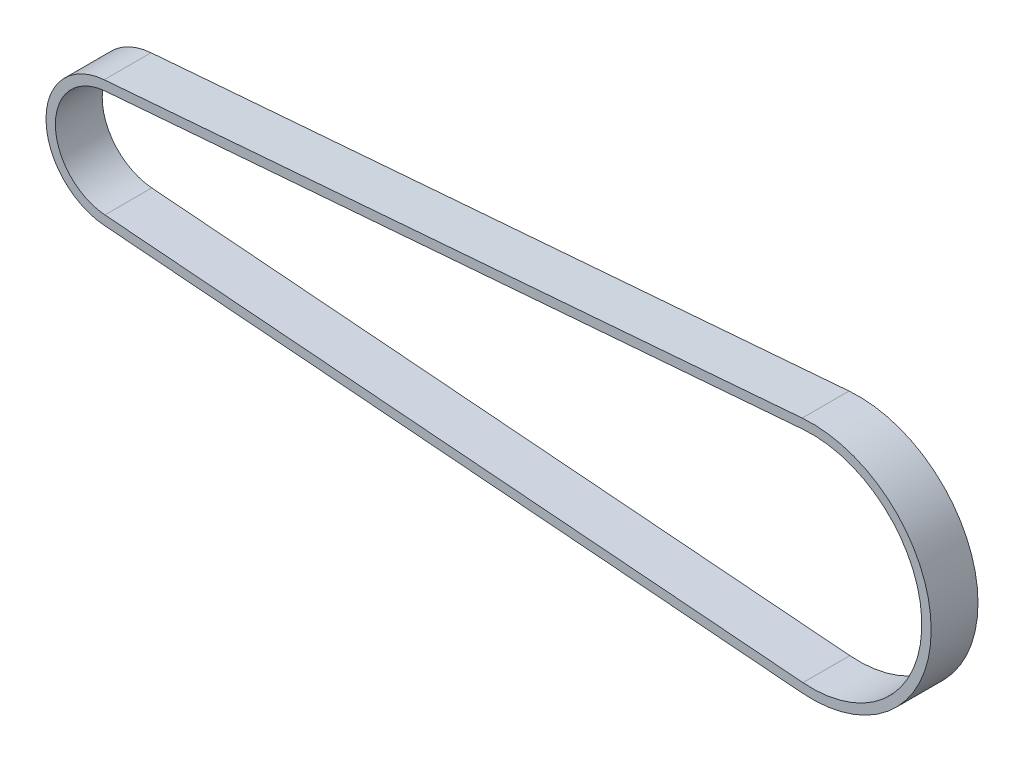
ISO-10303-21;
HEADER;
FILE_DESCRIPTION(('STEP AP214'),'2;1');
FILE_NAME('part.step','',(''),(''),'','','');
FILE_SCHEMA(('AUTOMOTIVE_DESIGN { 1 0 10303 214 1 1 1 1 }'));
ENDSEC;
DATA;
#1=APPLICATION_CONTEXT('core data for automotive mechanical design processes');
#2=APPLICATION_PROTOCOL_DEFINITION('international standard','automotive_design',2000,#1);
#3=PRODUCT_CONTEXT('',#1,'mechanical');
#4=PRODUCT('Part','Part','',(#3));
#5=PRODUCT_RELATED_PRODUCT_CATEGORY('part','',(#4));
#6=PRODUCT_DEFINITION_FORMATION('','',#4);
#7=PRODUCT_DEFINITION_CONTEXT('part definition',#1,'design');
#8=PRODUCT_DEFINITION('design','',#6,#7);
#9=PRODUCT_DEFINITION_SHAPE('','',#8);
#10=(LENGTH_UNIT() NAMED_UNIT(*) SI_UNIT(.MILLI.,.METRE.));
#11=(NAMED_UNIT(*) PLANE_ANGLE_UNIT() SI_UNIT($,.RADIAN.));
#12=(NAMED_UNIT(*) SI_UNIT($,.STERADIAN.) SOLID_ANGLE_UNIT());
#13=UNCERTAINTY_MEASURE_WITH_UNIT(LENGTH_MEASURE(1.E-05),#10,'distance_accuracy_value','');
#14=(GEOMETRIC_REPRESENTATION_CONTEXT(3) GLOBAL_UNCERTAINTY_ASSIGNED_CONTEXT((#13)) GLOBAL_UNIT_ASSIGNED_CONTEXT((#10,
#11,#12)) REPRESENTATION_CONTEXT('',''));
#15=CARTESIAN_POINT('',(0.,0.,0.));
#16=DIRECTION('',(0.,0.,1.));
#17=DIRECTION('',(1.,0.,0.));
#18=AXIS2_PLACEMENT_3D('',#15,#16,#17);
#19=CARTESIAN_POINT('',(-150.,0.,10.));
#20=DIRECTION('',(0.,0.,1.));
#21=DIRECTION('',(1.,0.,0.));
#22=AXIS2_PLACEMENT_3D('',#19,#20,#21);
#23=PLANE('',#22);
#24=CARTESIAN_POINT('',(-150.,0.,10.));
#25=DIRECTION('',(0.,0.,1.));
#26=DIRECTION('',(1.,0.,0.));
#27=AXIS2_PLACEMENT_3D('',#24,#25,#26);
#28=CIRCLE('',#27,13.5);
#29=CARTESIAN_POINT('',(-151.08,13.4567306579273,10.));
#30=VERTEX_POINT('',#29);
#31=CARTESIAN_POINT('',(-151.08,-13.4567306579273,10.));
#32=VERTEX_POINT('',#31);
#33=EDGE_CURVE('E155',#30,#32,#28,.T.);
#34=ORIENTED_EDGE('',*,*,#33,.T.);
#35=DIRECTION('',(0.996794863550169,-0.0799999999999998,0.));
#36=VECTOR('',#35,1.);
#37=CARTESIAN_POINT('',(-151.08,-13.4567306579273,10.));
#38=LINE('',#37,#36);
#39=CARTESIAN_POINT('',(-2.03999999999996,-25.4182690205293,10.));
#40=VERTEX_POINT('',#39);
#41=EDGE_CURVE('E158',#32,#40,#38,.T.);
#42=ORIENTED_EDGE('',*,*,#41,.T.);
#43=CARTESIAN_POINT('',(0.,0.,10.));
#44=DIRECTION('',(0.,0.,1.));
#45=DIRECTION('',(1.,0.,0.));
#46=AXIS2_PLACEMENT_3D('',#43,#44,#45);
#47=CIRCLE('',#46,25.5);
#48=CARTESIAN_POINT('',(-2.04,25.4182690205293,10.));
#49=VERTEX_POINT('',#48);
#50=EDGE_CURVE('E161',#40,#49,#47,.T.);
#51=ORIENTED_EDGE('',*,*,#50,.T.);
#52=DIRECTION('',(-0.996794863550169,-0.08,0.));
#53=VECTOR('',#52,1.);
#54=CARTESIAN_POINT('',(-151.08,13.4567306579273,10.));
#55=LINE('',#54,#53);
#56=EDGE_CURVE('E163',#49,#30,#55,.T.);
#57=ORIENTED_EDGE('',*,*,#56,.T.);
#58=EDGE_LOOP('',(#34,#42,#51,#57));
#59=FACE_BOUND('',#58,.T.);
#60=DIRECTION('',(0.996794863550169,-0.0799999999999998,0.));
#61=VECTOR('',#60,1.);
#62=CARTESIAN_POINT('',(-150.92,-11.463140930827,10.));
#63=LINE('',#62,#61);
#64=CARTESIAN_POINT('',(-150.92,-11.463140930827,10.));
#65=VERTEX_POINT('',#64);
#66=CARTESIAN_POINT('',(-1.88,-23.424679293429,10.));
#67=VERTEX_POINT('',#66);
#68=EDGE_CURVE('E127',#65,#67,#63,.T.);
#69=ORIENTED_EDGE('',*,*,#68,.F.);
#70=CARTESIAN_POINT('',(-150.,0.,10.));
#71=DIRECTION('',(0.,0.,1.));
#72=DIRECTION('',(1.,0.,0.));
#73=AXIS2_PLACEMENT_3D('',#70,#71,#72);
#74=CIRCLE('',#73,11.5);
#75=CARTESIAN_POINT('',(-150.92,11.4631409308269,10.));
#76=VERTEX_POINT('',#75);
#77=EDGE_CURVE('E119',#76,#65,#74,.T.);
#78=ORIENTED_EDGE('',*,*,#77,.F.);
#79=DIRECTION('',(-0.996794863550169,-0.08,0.));
#80=VECTOR('',#79,1.);
#81=CARTESIAN_POINT('',(-150.92,11.4631409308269,10.));
#82=LINE('',#81,#80);
#83=CARTESIAN_POINT('',(-1.88000000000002,23.424679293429,10.));
#84=VERTEX_POINT('',#83);
#85=EDGE_CURVE('E141',#84,#76,#82,.T.);
#86=ORIENTED_EDGE('',*,*,#85,.F.);
#87=CARTESIAN_POINT('',(0.,0.,10.));
#88=DIRECTION('',(0.,0.,1.));
#89=DIRECTION('',(1.,0.,0.));
#90=AXIS2_PLACEMENT_3D('',#87,#88,#89);
#91=CIRCLE('',#90,23.5);
#92=EDGE_CURVE('E139',#67,#84,#91,.T.);
#93=ORIENTED_EDGE('',*,*,#92,.F.);
#94=EDGE_LOOP('',(#69,#78,#86,#93));
#95=FACE_BOUND('',#94,.T.);
#96=ADVANCED_FACE('F54',(#59,#95),#23,.T.);
#97=CARTESIAN_POINT('',(-150.,0.,0.));
#98=DIRECTION('',(0.,0.,1.));
#99=DIRECTION('',(1.,0.,0.));
#100=AXIS2_PLACEMENT_3D('',#97,#98,#99);
#101=PLANE('',#100);
#102=CARTESIAN_POINT('',(-150.,0.,0.));
#103=DIRECTION('',(0.,0.,1.));
#104=DIRECTION('',(1.,0.,0.));
#105=AXIS2_PLACEMENT_3D('',#102,#103,#104);
#106=CIRCLE('',#105,13.5);
#107=CARTESIAN_POINT('',(-151.08,13.4567306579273,0.));
#108=VERTEX_POINT('',#107);
#109=CARTESIAN_POINT('',(-151.08,-13.4567306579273,0.));
#110=VERTEX_POINT('',#109);
#111=EDGE_CURVE('E135',#108,#110,#106,.T.);
#112=ORIENTED_EDGE('',*,*,#111,.F.);
#113=DIRECTION('',(-0.996794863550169,-0.08,0.));
#114=VECTOR('',#113,1.);
#115=CARTESIAN_POINT('',(-151.08,13.4567306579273,0.));
#116=LINE('',#115,#114);
#117=CARTESIAN_POINT('',(-2.04,25.4182690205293,0.));
#118=VERTEX_POINT('',#117);
#119=EDGE_CURVE('E159',#118,#108,#116,.T.);
#120=ORIENTED_EDGE('',*,*,#119,.F.);
#121=CARTESIAN_POINT('',(0.,0.,0.));
#122=DIRECTION('',(0.,0.,1.));
#123=DIRECTION('',(1.,0.,0.));
#124=AXIS2_PLACEMENT_3D('',#121,#122,#123);
#125=CIRCLE('',#124,25.5);
#126=CARTESIAN_POINT('',(-2.03999999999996,-25.4182690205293,0.));
#127=VERTEX_POINT('',#126);
#128=EDGE_CURVE('E170',#127,#118,#125,.T.);
#129=ORIENTED_EDGE('',*,*,#128,.F.);
#130=DIRECTION('',(0.996794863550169,-0.0799999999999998,0.));
#131=VECTOR('',#130,1.);
#132=CARTESIAN_POINT('',(-151.08,-13.4567306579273,0.));
#133=LINE('',#132,#131);
#134=EDGE_CURVE('E168',#110,#127,#133,.T.);
#135=ORIENTED_EDGE('',*,*,#134,.F.);
#136=EDGE_LOOP('',(#112,#120,#129,#135));
#137=FACE_BOUND('',#136,.T.);
#138=CARTESIAN_POINT('',(-150.,0.,0.));
#139=DIRECTION('',(0.,0.,1.));
#140=DIRECTION('',(1.,0.,0.));
#141=AXIS2_PLACEMENT_3D('',#138,#139,#140);
#142=CIRCLE('',#141,11.5);
#143=CARTESIAN_POINT('',(-150.92,11.4631409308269,0.));
#144=VERTEX_POINT('',#143);
#145=CARTESIAN_POINT('',(-150.92,-11.463140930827,0.));
#146=VERTEX_POINT('',#145);
#147=EDGE_CURVE('E77',#144,#146,#142,.T.);
#148=ORIENTED_EDGE('',*,*,#147,.T.);
#149=DIRECTION('',(0.996794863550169,-0.0799999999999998,0.));
#150=VECTOR('',#149,1.);
#151=CARTESIAN_POINT('',(-150.92,-11.463140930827,0.));
#152=LINE('',#151,#150);
#153=CARTESIAN_POINT('',(-1.88,-23.424679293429,0.));
#154=VERTEX_POINT('',#153);
#155=EDGE_CURVE('E134',#146,#154,#152,.T.);
#156=ORIENTED_EDGE('',*,*,#155,.T.);
#157=CARTESIAN_POINT('',(0.,0.,0.));
#158=DIRECTION('',(0.,0.,1.));
#159=DIRECTION('',(1.,0.,0.));
#160=AXIS2_PLACEMENT_3D('',#157,#158,#159);
#161=CIRCLE('',#160,23.5);
#162=CARTESIAN_POINT('',(-1.88,23.424679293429,0.));
#163=VERTEX_POINT('',#162);
#164=EDGE_CURVE('E147',#154,#163,#161,.T.);
#165=ORIENTED_EDGE('',*,*,#164,.T.);
#166=DIRECTION('',(-0.996794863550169,-0.08,0.));
#167=VECTOR('',#166,1.);
#168=CARTESIAN_POINT('',(-150.92,11.4631409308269,0.));
#169=LINE('',#168,#167);
#170=EDGE_CURVE('E128',#163,#144,#169,.T.);
#171=ORIENTED_EDGE('',*,*,#170,.T.);
#172=EDGE_LOOP('',(#148,#156,#165,#171));
#173=FACE_BOUND('',#172,.T.);
#174=ADVANCED_FACE('F188',(#137,#173),#101,.F.);
#175=CARTESIAN_POINT('',(-150.,0.,10.));
#176=DIRECTION('',(0.,0.,-1.));
#177=DIRECTION('',(-1.,0.,0.));
#178=AXIS2_PLACEMENT_3D('',#175,#176,#177);
#179=CYLINDRICAL_SURFACE('',#178,13.5);
#180=ORIENTED_EDGE('',*,*,#111,.T.);
#181=DIRECTION('',(0.,0.,-1.));
#182=VECTOR('',#181,1.);
#183=CARTESIAN_POINT('',(-151.08,-13.4567306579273,10.));
#184=LINE('',#183,#182);
#185=EDGE_CURVE('E12',#32,#110,#184,.T.);
#186=ORIENTED_EDGE('',*,*,#185,.F.);
#187=ORIENTED_EDGE('',*,*,#33,.F.);
#188=DIRECTION('',(0.,0.,-1.));
#189=VECTOR('',#188,1.);
#190=CARTESIAN_POINT('',(-151.08,13.4567306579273,10.));
#191=LINE('',#190,#189);
#192=EDGE_CURVE('E165',#30,#108,#191,.T.);
#193=ORIENTED_EDGE('',*,*,#192,.T.);
#194=EDGE_LOOP('',(#180,#186,#187,#193));
#195=FACE_BOUND('',#194,.T.);
#196=ADVANCED_FACE('F56',(#195),#179,.T.);
#197=CARTESIAN_POINT('',(-151.08,-13.4567306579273,10.));
#198=DIRECTION('',(0.0799999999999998,0.996794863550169,0.));
#199=DIRECTION('',(-0.996794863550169,0.0799999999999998,0.));
#200=AXIS2_PLACEMENT_3D('',#197,#198,#199);
#201=PLANE('',#200);
#202=ORIENTED_EDGE('',*,*,#134,.T.);
#203=DIRECTION('',(0.,0.,-1.));
#204=VECTOR('',#203,1.);
#205=CARTESIAN_POINT('',(-2.03999999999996,-25.4182690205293,10.));
#206=LINE('',#205,#204);
#207=EDGE_CURVE('E62',#40,#127,#206,.T.);
#208=ORIENTED_EDGE('',*,*,#207,.F.);
#209=ORIENTED_EDGE('',*,*,#41,.F.);
#210=ORIENTED_EDGE('',*,*,#185,.T.);
#211=EDGE_LOOP('',(#202,#208,#209,#210));
#212=FACE_BOUND('',#211,.T.);
#213=ADVANCED_FACE('F198',(#212),#201,.F.);
#214=CARTESIAN_POINT('',(0.,0.,10.));
#215=DIRECTION('',(0.,0.,-1.));
#216=DIRECTION('',(-1.,0.,0.));
#217=AXIS2_PLACEMENT_3D('',#214,#215,#216);
#218=CYLINDRICAL_SURFACE('',#217,25.5);
#219=ORIENTED_EDGE('',*,*,#128,.T.);
#220=DIRECTION('',(0.,0.,-1.));
#221=VECTOR('',#220,1.);
#222=CARTESIAN_POINT('',(-2.04,25.4182690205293,10.));
#223=LINE('',#222,#221);
#224=EDGE_CURVE('E175',#49,#118,#223,.T.);
#225=ORIENTED_EDGE('',*,*,#224,.F.);
#226=ORIENTED_EDGE('',*,*,#50,.F.);
#227=ORIENTED_EDGE('',*,*,#207,.T.);
#228=EDGE_LOOP('',(#219,#225,#226,#227));
#229=FACE_BOUND('',#228,.T.);
#230=ADVANCED_FACE('F182',(#229),#218,.T.);
#231=CARTESIAN_POINT('',(-151.08,13.4567306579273,10.));
#232=DIRECTION('',(0.08,-0.996794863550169,0.));
#233=DIRECTION('',(0.996794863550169,0.08,0.));
#234=AXIS2_PLACEMENT_3D('',#231,#232,#233);
#235=PLANE('',#234);
#236=ORIENTED_EDGE('',*,*,#119,.T.);
#237=ORIENTED_EDGE('',*,*,#192,.F.);
#238=ORIENTED_EDGE('',*,*,#56,.F.);
#239=ORIENTED_EDGE('',*,*,#224,.T.);
#240=EDGE_LOOP('',(#236,#237,#238,#239));
#241=FACE_BOUND('',#240,.T.);
#242=ADVANCED_FACE('F192',(#241),#235,.F.);
#243=CARTESIAN_POINT('',(-150.,0.,10.));
#244=DIRECTION('',(0.,0.,-1.));
#245=DIRECTION('',(-1.,0.,0.));
#246=AXIS2_PLACEMENT_3D('',#243,#244,#245);
#247=CYLINDRICAL_SURFACE('',#246,11.5);
#248=ORIENTED_EDGE('',*,*,#147,.F.);
#249=DIRECTION('',(0.,0.,-1.));
#250=VECTOR('',#249,1.);
#251=CARTESIAN_POINT('',(-150.92,11.4631409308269,10.));
#252=LINE('',#251,#250);
#253=EDGE_CURVE('E123',#76,#144,#252,.T.);
#254=ORIENTED_EDGE('',*,*,#253,.F.);
#255=ORIENTED_EDGE('',*,*,#77,.T.);
#256=DIRECTION('',(0.,0.,-1.));
#257=VECTOR('',#256,1.);
#258=CARTESIAN_POINT('',(-150.92,-11.463140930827,10.));
#259=LINE('',#258,#257);
#260=EDGE_CURVE('E122',#65,#146,#259,.T.);
#261=ORIENTED_EDGE('',*,*,#260,.T.);
#262=EDGE_LOOP('',(#248,#254,#255,#261));
#263=FACE_BOUND('',#262,.T.);
#264=ADVANCED_FACE('F121',(#263),#247,.F.);
#265=CARTESIAN_POINT('',(-150.92,-11.463140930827,10.));
#266=DIRECTION('',(0.0799999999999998,0.996794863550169,0.));
#267=DIRECTION('',(-0.996794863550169,0.0799999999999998,0.));
#268=AXIS2_PLACEMENT_3D('',#265,#266,#267);
#269=PLANE('',#268);
#270=ORIENTED_EDGE('',*,*,#155,.F.);
#271=ORIENTED_EDGE('',*,*,#260,.F.);
#272=ORIENTED_EDGE('',*,*,#68,.T.);
#273=DIRECTION('',(0.,0.,-1.));
#274=VECTOR('',#273,1.);
#275=CARTESIAN_POINT('',(-1.88,-23.424679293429,10.));
#276=LINE('',#275,#274);
#277=EDGE_CURVE('E136',#67,#154,#276,.T.);
#278=ORIENTED_EDGE('',*,*,#277,.T.);
#279=EDGE_LOOP('',(#270,#271,#272,#278));
#280=FACE_BOUND('',#279,.T.);
#281=ADVANCED_FACE('F131',(#280),#269,.T.);
#282=CARTESIAN_POINT('',(0.,0.,10.));
#283=DIRECTION('',(0.,0.,-1.));
#284=DIRECTION('',(-1.,0.,0.));
#285=AXIS2_PLACEMENT_3D('',#282,#283,#284);
#286=CYLINDRICAL_SURFACE('',#285,23.5);
#287=ORIENTED_EDGE('',*,*,#164,.F.);
#288=ORIENTED_EDGE('',*,*,#277,.F.);
#289=ORIENTED_EDGE('',*,*,#92,.T.);
#290=DIRECTION('',(0.,0.,-1.));
#291=VECTOR('',#290,1.);
#292=CARTESIAN_POINT('',(-1.88,23.424679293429,10.));
#293=LINE('',#292,#291);
#294=EDGE_CURVE('E69',#84,#163,#293,.T.);
#295=ORIENTED_EDGE('',*,*,#294,.T.);
#296=EDGE_LOOP('',(#287,#288,#289,#295));
#297=FACE_BOUND('',#296,.T.);
#298=ADVANCED_FACE('F221',(#297),#286,.F.);
#299=CARTESIAN_POINT('',(-150.92,11.4631409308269,10.));
#300=DIRECTION('',(0.08,-0.996794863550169,0.));
#301=DIRECTION('',(0.996794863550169,0.08,0.));
#302=AXIS2_PLACEMENT_3D('',#299,#300,#301);
#303=PLANE('',#302);
#304=ORIENTED_EDGE('',*,*,#170,.F.);
#305=ORIENTED_EDGE('',*,*,#294,.F.);
#306=ORIENTED_EDGE('',*,*,#85,.T.);
#307=ORIENTED_EDGE('',*,*,#253,.T.);
#308=EDGE_LOOP('',(#304,#305,#306,#307));
#309=FACE_BOUND('',#308,.T.);
#310=ADVANCED_FACE('F225',(#309),#303,.T.);
#311=CLOSED_SHELL('',(#96,#174,#196,#213,#230,#242,#264,#281,#298,#310));
#312=MANIFOLD_SOLID_BREP('B2',#311);
#313=ADVANCED_BREP_SHAPE_REPRESENTATION('',(#18,#312),#14);
#314=SHAPE_DEFINITION_REPRESENTATION(#9,#313);
ENDSEC;
END-ISO-10303-21;
